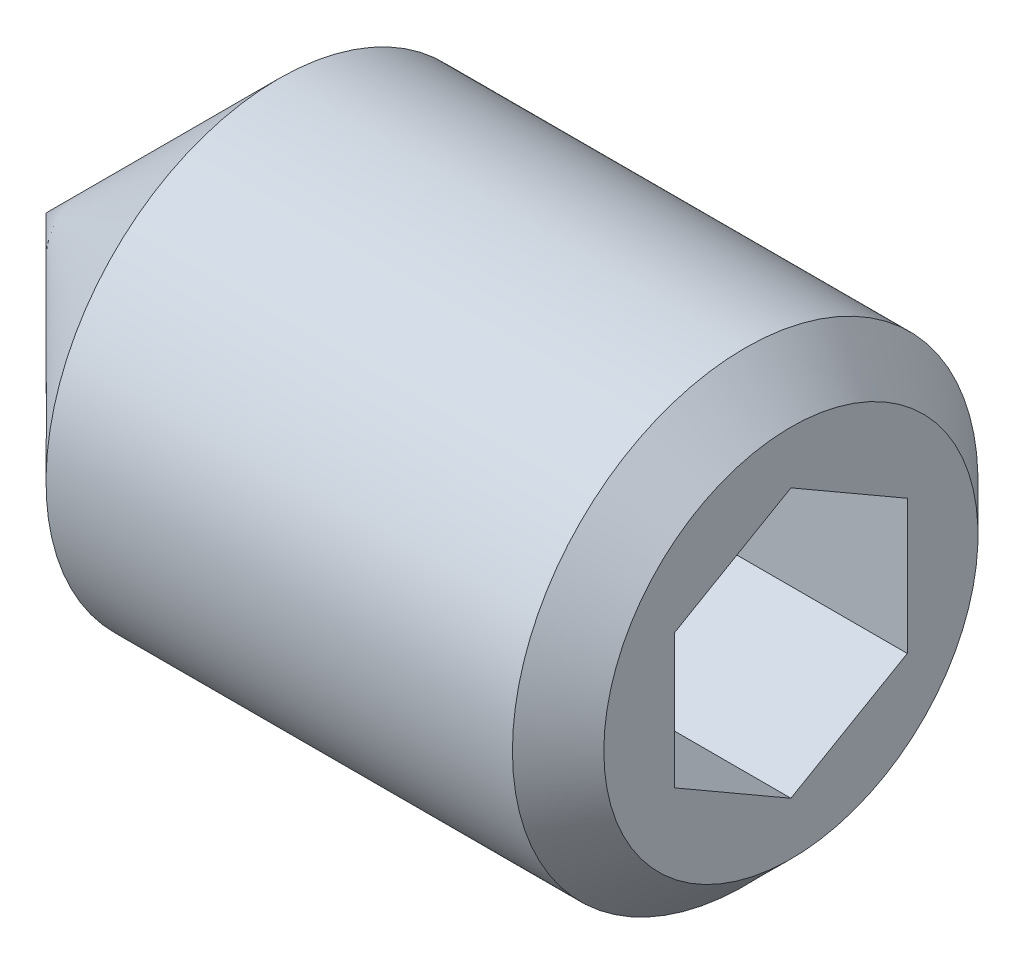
ISO-10303-21;
HEADER;
FILE_DESCRIPTION(('STEP AP214'),'2;1');
FILE_NAME('part.step','',(''),(''),'','','');
FILE_SCHEMA(('AUTOMOTIVE_DESIGN { 1 0 10303 214 1 1 1 1 }'));
ENDSEC;
DATA;
#1=APPLICATION_CONTEXT('core data for automotive mechanical design processes');
#2=APPLICATION_PROTOCOL_DEFINITION('international standard','automotive_design',2000,#1);
#3=PRODUCT_CONTEXT('',#1,'mechanical');
#4=PRODUCT('Part','Part','',(#3));
#5=PRODUCT_RELATED_PRODUCT_CATEGORY('part','',(#4));
#6=PRODUCT_DEFINITION_FORMATION('','',#4);
#7=PRODUCT_DEFINITION_CONTEXT('part definition',#1,'design');
#8=PRODUCT_DEFINITION('design','',#6,#7);
#9=PRODUCT_DEFINITION_SHAPE('','',#8);
#10=(LENGTH_UNIT() NAMED_UNIT(*) SI_UNIT(.MILLI.,.METRE.));
#11=(NAMED_UNIT(*) PLANE_ANGLE_UNIT() SI_UNIT($,.RADIAN.));
#12=(NAMED_UNIT(*) SI_UNIT($,.STERADIAN.) SOLID_ANGLE_UNIT());
#13=UNCERTAINTY_MEASURE_WITH_UNIT(LENGTH_MEASURE(1.E-05),#10,'distance_accuracy_value','');
#14=(GEOMETRIC_REPRESENTATION_CONTEXT(3) GLOBAL_UNCERTAINTY_ASSIGNED_CONTEXT((#13)) GLOBAL_UNIT_ASSIGNED_CONTEXT((#10,
#11,#12)) REPRESENTATION_CONTEXT('',''));
#15=CARTESIAN_POINT('',(0.,0.,0.));
#16=DIRECTION('',(0.,0.,1.));
#17=DIRECTION('',(1.,0.,0.));
#18=AXIS2_PLACEMENT_3D('',#15,#16,#17);
#19=CARTESIAN_POINT('',(7.99999999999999,-0.721687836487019,-1.25));
#20=DIRECTION('',(0.,0.,-1.));
#21=DIRECTION('',(-1.,0.,0.));
#22=AXIS2_PLACEMENT_3D('',#19,#20,#21);
#23=PLANE('',#22);
#24=DIRECTION('',(1.,0.,0.));
#25=VECTOR('',#24,1.);
#26=CARTESIAN_POINT('',(7.99999999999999,-0.721687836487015,-1.25000000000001));
#27=LINE('',#26,#25);
#28=CARTESIAN_POINT('',(5.00000000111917,-0.721687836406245,-1.2499999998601));
#29=VERTEX_POINT('',#28);
#30=CARTESIAN_POINT('',(7.99999999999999,-0.721687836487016,-1.25));
#31=VERTEX_POINT('',#30);
#32=EDGE_CURVE('E77',#29,#31,#27,.T.);
#33=ORIENTED_EDGE('',*,*,#32,.T.);
#34=DIRECTION('',(0.,1.,0.));
#35=VECTOR('',#34,1.);
#36=CARTESIAN_POINT('',(7.99999999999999,-0.721687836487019,-1.25));
#37=LINE('',#36,#35);
#38=CARTESIAN_POINT('',(7.99999999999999,0.721687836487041,-1.25));
#39=VERTEX_POINT('',#38);
#40=EDGE_CURVE('E83',#39,#31,#37,.F.);
#41=ORIENTED_EDGE('',*,*,#40,.F.);
#42=DIRECTION('',(1.,0.,0.));
#43=VECTOR('',#42,1.);
#44=CARTESIAN_POINT('',(7.99999999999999,0.721687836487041,-1.25));
#45=LINE('',#44,#43);
#46=CARTESIAN_POINT('',(5.00000000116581,0.721687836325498,-1.25));
#47=VERTEX_POINT('',#46);
#48=EDGE_CURVE('E80',#39,#47,#45,.F.);
#49=ORIENTED_EDGE('',*,*,#48,.T.);
#50=CARTESIAN_POINT('',(5.00000000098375,-0.721687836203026,-1.25000000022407));
#51=CARTESIAN_POINT('',(4.98168471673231,-0.658260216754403,-1.25000000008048));
#52=CARTESIAN_POINT('',(4.96502792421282,-0.594285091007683,-1.25000000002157));
#53=CARTESIAN_POINT('',(4.93595399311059,-0.465227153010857,-1.24999999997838));
#54=CARTESIAN_POINT('',(4.92354713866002,-0.400142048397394,-1.24999999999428));
#55=CARTESIAN_POINT('',(4.90423497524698,-0.270778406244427,-1.25000000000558));
#56=CARTESIAN_POINT('',(4.89720111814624,-0.206519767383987,-1.25000000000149));
#57=CARTESIAN_POINT('',(4.88880573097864,-0.0777002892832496,-1.24999999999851));
#58=CARTESIAN_POINT('',(4.88743724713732,-0.0131399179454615,-1.24999999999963));
#59=CARTESIAN_POINT('',(4.8902914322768,0.107484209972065,-1.25000000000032));
#60=CARTESIAN_POINT('',(4.89381330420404,0.163566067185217,-1.25000000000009));
#61=CARTESIAN_POINT('',(4.90497331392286,0.275364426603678,-1.24999999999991));
#62=CARTESIAN_POINT('',(4.91261526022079,0.331080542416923,-1.24999999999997));
#63=CARTESIAN_POINT('',(4.93171864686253,0.443109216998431,-1.25000000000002));
#64=CARTESIAN_POINT('',(4.94326102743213,0.499407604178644,-1.25000000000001));
#65=CARTESIAN_POINT('',(4.96945735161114,0.611164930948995,-1.24999999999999));
#66=CARTESIAN_POINT('',(4.98410514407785,0.666625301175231,-1.24999999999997));
#67=CARTESIAN_POINT('',(5.00000000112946,0.721687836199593,-1.25));
#68=B_SPLINE_CURVE_WITH_KNOTS('',3,(#50,#51,#52,#53,#54,#55,#56,#57,#58,#59,#60,#61,#62,#63,#64,
#65,#66,#67),.UNSPECIFIED.,.F.,.F.,(4,2,2,2,2,2,2,2,4),(0.,0.198135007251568,0.396746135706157,
0.590442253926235,0.783900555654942,0.952317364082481,1.12089012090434,1.29320101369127,
1.46517373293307),.UNSPECIFIED.);
#69=EDGE_CURVE('E20',#29,#47,#68,.T.);
#70=ORIENTED_EDGE('',*,*,#69,.F.);
#71=EDGE_LOOP('',(#33,#41,#49,#70));
#72=FACE_BOUND('',#71,.T.);
#73=ADVANCED_FACE('F16',(#72),#23,.F.);
#74=CARTESIAN_POINT('',(7.99999999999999,-1.44337567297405,0.));
#75=DIRECTION('',(0.,-0.866025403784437,-0.500000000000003));
#76=DIRECTION('',(0.,0.500000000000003,-0.866025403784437));
#77=AXIS2_PLACEMENT_3D('',#74,#75,#76);
#78=PLANE('',#77);
#79=DIRECTION('',(1.,0.,0.));
#80=VECTOR('',#79,1.);
#81=CARTESIAN_POINT('',(7.99999999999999,-1.44337567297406,0.));
#82=LINE('',#81,#80);
#83=CARTESIAN_POINT('',(5.00000000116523,-1.4433756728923,-1.41620604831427E-10));
#84=VERTEX_POINT('',#83);
#85=CARTESIAN_POINT('',(7.99999999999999,-1.44337567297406,0.));
#86=VERTEX_POINT('',#85);
#87=EDGE_CURVE('E144',#84,#86,#82,.T.);
#88=ORIENTED_EDGE('',*,*,#87,.T.);
#89=DIRECTION('',(0.,0.500000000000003,-0.866025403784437));
#90=VECTOR('',#89,1.);
#91=CARTESIAN_POINT('',(7.99999999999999,-1.44337567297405,0.));
#92=LINE('',#91,#90);
#93=EDGE_CURVE('E93',#31,#86,#92,.F.);
#94=ORIENTED_EDGE('',*,*,#93,.F.);
#95=ORIENTED_EDGE('',*,*,#32,.F.);
#96=CARTESIAN_POINT('',(5.00000000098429,-1.44337567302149,-3.60436117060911E-10));
#97=CARTESIAN_POINT('',(4.98168471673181,-1.41166186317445,-0.0549299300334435));
#98=CARTESIAN_POINT('',(4.96502792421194,-1.37967430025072,-0.110334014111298));
#99=CARTESIAN_POINT('',(4.93595399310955,-1.31514533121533,-0.22210146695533));
#100=CARTESIAN_POINT('',(4.92354713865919,-1.28260277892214,-0.278466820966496));
#101=CARTESIAN_POINT('',(4.90423497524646,-1.21792095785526,-0.390499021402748));
#102=CARTESIAN_POINT('',(4.89720111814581,-1.18579163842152,-0.446148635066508));
#103=CARTESIAN_POINT('',(4.88880573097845,-1.12138189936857,-0.557709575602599));
#104=CARTESIAN_POINT('',(4.88743724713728,-1.0891017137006,-0.613620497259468));
#105=CARTESIAN_POINT('',(4.89029143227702,-1.02878964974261,-0.718084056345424));
#106=CARTESIAN_POINT('',(4.89381330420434,-1.00074872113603,-0.766652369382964));
#107=CARTESIAN_POINT('',(4.90497331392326,-0.944849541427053,-0.863472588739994));
#108=CARTESIAN_POINT('',(4.9126152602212,-0.916991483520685,-0.911724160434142));
#109=CARTESIAN_POINT('',(4.9317186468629,-0.860977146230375,-1.00874383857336));
#110=CARTESIAN_POINT('',(4.94326102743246,-0.832827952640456,-1.05749967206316));
#111=CARTESIAN_POINT('',(4.96945735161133,-0.776949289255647,-1.15428435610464));
#112=CARTESIAN_POINT('',(4.98410514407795,-0.749219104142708,-1.20231444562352));
#113=CARTESIAN_POINT('',(5.00000000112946,-0.721687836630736,-1.24999999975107));
#114=B_SPLINE_CURVE_WITH_KNOTS('',3,(#96,#97,#98,#99,#100,#101,#102,#103,#104,#105,#106,#107,
#108,#109,#110,#111,#112,#113),.UNSPECIFIED.,.F.,.F.,(4,2,2,2,2,2,2,2,4),(0.,0.198135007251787,
0.396746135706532,0.5904422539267,0.78390055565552,0.952317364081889,1.12089012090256,
1.29320101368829,1.46517373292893),.UNSPECIFIED.);
#115=EDGE_CURVE('E85',#84,#29,#114,.T.);
#116=ORIENTED_EDGE('',*,*,#115,.F.);
#117=EDGE_LOOP('',(#88,#94,#95,#116));
#118=FACE_BOUND('',#117,.T.);
#119=ADVANCED_FACE('F94',(#118),#78,.F.);
#120=CARTESIAN_POINT('',(7.99999999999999,0.721687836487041,-1.25));
#121=DIRECTION('',(0.,0.86602540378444,-0.499999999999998));
#122=DIRECTION('',(0.,0.499999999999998,0.86602540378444));
#123=AXIS2_PLACEMENT_3D('',#120,#121,#122);
#124=PLANE('',#123);
#125=ORIENTED_EDGE('',*,*,#48,.F.);
#126=DIRECTION('',(0.,0.499999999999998,0.86602540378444));
#127=VECTOR('',#126,1.);
#128=CARTESIAN_POINT('',(7.99999999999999,0.721687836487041,-1.25));
#129=LINE('',#128,#127);
#130=CARTESIAN_POINT('',(7.99999999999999,1.44337567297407,0.));
#131=VERTEX_POINT('',#130);
#132=EDGE_CURVE('E92',#131,#39,#129,.F.);
#133=ORIENTED_EDGE('',*,*,#132,.F.);
#134=DIRECTION('',(1.,0.,0.));
#135=VECTOR('',#134,1.);
#136=CARTESIAN_POINT('',(7.99999999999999,1.44337567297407,0.));
#137=LINE('',#136,#135);
#138=CARTESIAN_POINT('',(4.99999999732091,1.44337566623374,-1.16745889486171E-08));
#139=VERTEX_POINT('',#138);
#140=EDGE_CURVE('E189',#131,#139,#137,.F.);
#141=ORIENTED_EDGE('',*,*,#140,.T.);
#142=CARTESIAN_POINT('',(5.00000000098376,0.721687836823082,-1.24999999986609));
#143=CARTESIAN_POINT('',(4.98168471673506,0.753401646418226,-1.19507007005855));
#144=CARTESIAN_POINT('',(4.96502792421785,0.7853892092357,-1.13966598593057));
#145=CARTESIAN_POINT('',(4.93595399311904,0.849918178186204,-1.02789853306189));
#146=CARTESIAN_POINT('',(4.92354713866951,0.882460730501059,-0.971533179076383));
#147=CARTESIAN_POINT('',(4.90423497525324,0.947142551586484,-0.859500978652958));
#148=CARTESIAN_POINT('',(4.89720111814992,0.979271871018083,-0.803851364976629));
#149=CARTESIAN_POINT('',(4.88880573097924,1.04368161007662,-0.692290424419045));
#150=CARTESIAN_POINT('',(4.88743724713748,1.0759617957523,-0.63637950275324));
#151=CARTESIAN_POINT('',(4.89029143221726,1.13627385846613,-0.531915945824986));
#152=CARTESIAN_POINT('',(4.89381330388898,1.16431478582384,-0.483347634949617));
#153=CARTESIAN_POINT('',(4.90497331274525,1.22021396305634,-0.386527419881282));
#154=CARTESIAN_POINT('',(4.9126152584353,1.24807201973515,-0.338275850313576));
#155=CARTESIAN_POINT('',(4.93171864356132,1.30408635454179,-0.241256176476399));
#156=CARTESIAN_POINT('',(4.94326102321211,1.33223554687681,-0.19250034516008));
#157=CARTESIAN_POINT('',(4.96945734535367,1.38811420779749,-0.0957156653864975));
#158=CARTESIAN_POINT('',(4.98410513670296,1.41584439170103,-0.0476855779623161));
#159=CARTESIAN_POINT('',(4.99999999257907,1.44337565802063,-2.5900118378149E-08));
#160=B_SPLINE_CURVE_WITH_KNOTS('',3,(#142,#143,#144,#145,#146,#147,#148,#149,#150,#151,#152,
#153,#154,#155,#156,#157,#158,#159),.UNSPECIFIED.,.F.,.F.,(4,2,2,2,2,2,2,2,4),(0.,
0.198135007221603,0.396746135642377,0.590442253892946,0.783900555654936,0.952317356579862,
1.12089010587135,1.29320099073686,1.46517370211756),.UNSPECIFIED.);
#161=EDGE_CURVE('E139',#47,#139,#160,.T.);
#162=ORIENTED_EDGE('',*,*,#161,.F.);
#163=EDGE_LOOP('',(#125,#133,#141,#162));
#164=FACE_BOUND('',#163,.T.);
#165=ADVANCED_FACE('F145',(#164),#124,.F.);
#166=CARTESIAN_POINT('',(7.99999999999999,-0.721687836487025,1.25));
#167=DIRECTION('',(0.,-0.86602540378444,0.499999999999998));
#168=DIRECTION('',(0.,-0.499999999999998,-0.86602540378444));
#169=AXIS2_PLACEMENT_3D('',#166,#167,#168);
#170=PLANE('',#169);
#171=DIRECTION('',(1.,0.,0.));
#172=VECTOR('',#171,1.);
#173=CARTESIAN_POINT('',(7.99999999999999,-0.721687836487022,1.25));
#174=LINE('',#173,#172);
#175=CARTESIAN_POINT('',(4.99999999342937,-0.721687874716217,1.24999996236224));
#176=VERTEX_POINT('',#175);
#177=CARTESIAN_POINT('',(7.99999999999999,-0.721687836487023,1.25));
#178=VERTEX_POINT('',#177);
#179=EDGE_CURVE('E197',#176,#178,#174,.T.);
#180=ORIENTED_EDGE('',*,*,#179,.T.);
#181=DIRECTION('',(0.,-0.499999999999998,-0.86602540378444));
#182=VECTOR('',#181,1.);
#183=CARTESIAN_POINT('',(7.99999999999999,-0.721687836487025,1.25));
#184=LINE('',#183,#182);
#185=EDGE_CURVE('E190',#86,#178,#184,.F.);
#186=ORIENTED_EDGE('',*,*,#185,.F.);
#187=ORIENTED_EDGE('',*,*,#87,.F.);
#188=CARTESIAN_POINT('',(5.0000000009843,-1.44337567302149,3.60410740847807E-10));
#189=CARTESIAN_POINT('',(4.98168471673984,-1.41166186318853,0.0549299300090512));
#190=CARTESIAN_POINT('',(4.96502792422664,-1.37967430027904,0.110334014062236));
#191=CARTESIAN_POINT('',(4.93595399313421,-1.31514533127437,0.222101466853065));
#192=CARTESIAN_POINT('',(4.9235471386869,-1.28260277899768,0.278466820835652));
#193=CARTESIAN_POINT('',(4.90423497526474,-1.21792095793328,0.3904990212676));
#194=CARTESIAN_POINT('',(4.89720111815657,-1.18579163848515,0.446148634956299));
#195=CARTESIAN_POINT('',(4.88880573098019,-1.12138189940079,0.557709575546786));
#196=CARTESIAN_POINT('',(4.88743724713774,-1.08910171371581,0.613620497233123));
#197=CARTESIAN_POINT('',(4.89029143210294,-1.0287896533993,0.718084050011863));
#198=CARTESIAN_POINT('',(4.89381330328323,-1.00074872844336,0.766652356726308));
#199=CARTESIAN_POINT('',(4.90497331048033,-0.944849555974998,0.863472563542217));
#200=CARTESIAN_POINT('',(4.91261525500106,-0.916991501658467,0.911724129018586));
#201=CARTESIAN_POINT('',(4.93171863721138,-0.860977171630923,1.00874379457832));
#202=CARTESIAN_POINT('',(4.94326101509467,-0.832827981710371,1.0574996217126));
#203=CARTESIAN_POINT('',(4.96945733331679,-0.776949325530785,1.15428429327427));
#204=CARTESIAN_POINT('',(4.98410512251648,-0.749219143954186,1.20231437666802));
#205=CARTESIAN_POINT('',(4.99999997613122,-0.721687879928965,1.24999992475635));
#206=B_SPLINE_CURVE_WITH_KNOTS('',3,(#188,#189,#190,#191,#192,#193,#194,#195,#196,#197,#198,
#199,#200,#201,#202,#203,#204,#205),.UNSPECIFIED.,.F.,.F.,(4,2,2,2,2,2,2,2,4),(0.,
0.198135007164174,0.396746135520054,0.590442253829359,0.783900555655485,0.952317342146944,
1.12089007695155,1.29320094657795,1.46517364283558),.UNSPECIFIED.);
#207=EDGE_CURVE('E88',#84,#176,#206,.T.);
#208=ORIENTED_EDGE('',*,*,#207,.T.);
#209=EDGE_LOOP('',(#180,#186,#187,#208));
#210=FACE_BOUND('',#209,.T.);
#211=ADVANCED_FACE('F148',(#210),#170,.F.);
#212=CARTESIAN_POINT('',(7.99999999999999,1.44337567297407,0.));
#213=DIRECTION('',(0.,0.866025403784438,0.500000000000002));
#214=DIRECTION('',(0.,-0.500000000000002,0.866025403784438));
#215=AXIS2_PLACEMENT_3D('',#212,#213,#214);
#216=PLANE('',#215);
#217=ORIENTED_EDGE('',*,*,#140,.F.);
#218=DIRECTION('',(0.,-0.500000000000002,0.866025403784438));
#219=VECTOR('',#218,1.);
#220=CARTESIAN_POINT('',(7.99999999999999,1.44337567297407,0.));
#221=LINE('',#220,#219);
#222=CARTESIAN_POINT('',(7.99999999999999,0.721687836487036,1.25));
#223=VERTEX_POINT('',#222);
#224=EDGE_CURVE('E180',#223,#131,#221,.F.);
#225=ORIENTED_EDGE('',*,*,#224,.F.);
#226=DIRECTION('',(1.,0.,0.));
#227=VECTOR('',#226,1.);
#228=CARTESIAN_POINT('',(7.99999999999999,0.721687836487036,1.25));
#229=LINE('',#228,#227);
#230=CARTESIAN_POINT('',(4.99999998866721,0.721687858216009,1.24999996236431));
#231=VERTEX_POINT('',#230);
#232=EDGE_CURVE('E111',#223,#231,#229,.F.);
#233=ORIENTED_EDGE('',*,*,#232,.T.);
#234=CARTESIAN_POINT('',(4.99999997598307,0.721687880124,1.24999992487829));
#235=CARTESIAN_POINT('',(4.98168469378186,0.753401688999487,1.1950699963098));
#236=CARTESIAN_POINT('',(4.9650279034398,0.785389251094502,1.13966591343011));
#237=CARTESIAN_POINT('',(4.93595397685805,0.849918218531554,1.02789846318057));
#238=CARTESIAN_POINT('',(4.92354712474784,0.882460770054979,0.971533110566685));
#239=CARTESIAN_POINT('',(4.90423496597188,0.947142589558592,0.859500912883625));
#240=CARTESIAN_POINT('',(4.89720111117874,0.979271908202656,0.803851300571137));
#241=CARTESIAN_POINT('',(4.8888057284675,1.04368164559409,0.692290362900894));
#242=CARTESIAN_POINT('',(4.88743724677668,1.07596183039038,0.636379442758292));
#243=CARTESIAN_POINT('',(4.89029143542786,1.13627388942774,0.531915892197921));
#244=CARTESIAN_POINT('',(4.89381330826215,1.16431481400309,0.483347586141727));
#245=CARTESIAN_POINT('',(4.90497331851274,1.22021398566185,0.38652738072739));
#246=CARTESIAN_POINT('',(4.9126152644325,1.24807203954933,0.3382758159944));
#247=CARTESIAN_POINT('',(4.9317186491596,1.30408636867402,0.24125615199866));
#248=CARTESIAN_POINT('',(4.94326102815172,1.33223555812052,0.192500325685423));
#249=CARTESIAN_POINT('',(4.96945734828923,1.3881142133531,0.0957156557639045));
#250=CARTESIAN_POINT('',(4.9841051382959,1.41584439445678,0.0476855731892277));
#251=CARTESIAN_POINT('',(4.99999999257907,1.44337565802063,2.59001224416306E-08));
#252=B_SPLINE_CURVE_WITH_KNOTS('',3,(#234,#235,#236,#237,#238,#239,#240,#241,#242,#243,#244,
#245,#246,#247,#248,#249,#250,#251),.UNSPECIFIED.,.F.,.F.,(4,2,2,2,2,2,2,2,4),(0.,
0.198135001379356,0.396746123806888,0.590442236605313,0.783900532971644,0.952317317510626,
1.12089005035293,1.2932009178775,1.465173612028),.UNSPECIFIED.);
#253=EDGE_CURVE('E135',#231,#139,#252,.T.);
#254=ORIENTED_EDGE('',*,*,#253,.T.);
#255=EDGE_LOOP('',(#217,#225,#233,#254));
#256=FACE_BOUND('',#255,.T.);
#257=ADVANCED_FACE('F123',(#256),#216,.F.);
#258=CARTESIAN_POINT('',(5.00500000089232,0.,0.));
#259=DIRECTION('',(1.,0.,0.));
#260=DIRECTION('',(0.,1.,0.));
#261=AXIS2_PLACEMENT_3D('',#258,#259,#260);
#262=CONICAL_SURFACE('',#261,1.45203592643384,1.04719755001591);
#263=CARTESIAN_POINT('',(4.1666666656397,5.6843418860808E-11,0.));
#264=VERTEX_POINT('',#263);
#265=VERTEX_LOOP('',#264);
#266=FACE_BOUND('',#265,.T.);
#267=ORIENTED_EDGE('',*,*,#207,.F.);
#268=ORIENTED_EDGE('',*,*,#115,.T.);
#269=ORIENTED_EDGE('',*,*,#69,.T.);
#270=ORIENTED_EDGE('',*,*,#161,.T.);
#271=ORIENTED_EDGE('',*,*,#253,.F.);
#272=CARTESIAN_POINT('',(5.00000003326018,0.721687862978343,1.24999996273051));
#273=CARTESIAN_POINT('',(4.98168473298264,0.658260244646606,1.24999998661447));
#274=CARTESIAN_POINT('',(4.96502793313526,0.594285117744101,1.24999999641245));
#275=CARTESIAN_POINT('',(4.93595399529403,0.465227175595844,1.25000000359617));
#276=CARTESIAN_POINT('',(4.92354714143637,0.400142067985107,1.25000000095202));
#277=CARTESIAN_POINT('',(4.9042349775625,0.270778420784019,1.24999999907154));
#278=CARTESIAN_POINT('',(4.8972011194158,0.206519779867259,1.2499999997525));
#279=CARTESIAN_POINT('',(4.88880573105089,0.0777002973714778,1.25000000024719));
#280=CARTESIAN_POINT('',(4.88743724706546,0.0131399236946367,1.25000000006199));
#281=CARTESIAN_POINT('',(4.89029143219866,-0.107484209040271,1.24999999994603));
#282=CARTESIAN_POINT('',(4.89381330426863,-0.163566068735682,1.24999999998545));
#283=CARTESIAN_POINT('',(4.90497331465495,-0.275364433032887,1.25000000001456));
#284=CARTESIAN_POINT('',(4.91261526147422,-0.331080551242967,1.2500000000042));
#285=CARTESIAN_POINT('',(4.93171864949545,-0.443109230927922,1.24999999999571));
#286=CARTESIAN_POINT('',(4.94326103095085,-0.499407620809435,1.24999999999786));
#287=CARTESIAN_POINT('',(4.9694573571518,-0.611164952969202,1.25000000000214));
#288=CARTESIAN_POINT('',(4.98410515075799,-0.666625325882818,1.25000000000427));
#289=CARTESIAN_POINT('',(5.0000000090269,-0.721687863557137,1.25));
#290=B_SPLINE_CURVE_WITH_KNOTS('',3,(#272,#273,#274,#275,#276,#277,#278,#279,#280,#281,#282,
#283,#284,#285,#286,#287,#288,#289),.UNSPECIFIED.,.F.,.F.,(4,2,2,2,2,2,2,2,4),(0.,
0.198135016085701,0.396746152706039,0.590442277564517,0.783900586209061,0.952317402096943,
1.12089016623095,1.29320106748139,1.46517379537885),.UNSPECIFIED.);
#291=EDGE_CURVE('E105',#231,#176,#290,.T.);
#292=ORIENTED_EDGE('',*,*,#291,.T.);
#293=EDGE_LOOP('',(#267,#268,#269,#270,#271,#292));
#294=FACE_BOUND('',#293,.T.);
#295=ADVANCED_FACE('F86',(#266,#294),#262,.F.);
#296=CARTESIAN_POINT('',(7.99999999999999,0.721687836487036,1.25));
#297=DIRECTION('',(0.,0.,1.));
#298=DIRECTION('',(1.,0.,0.));
#299=AXIS2_PLACEMENT_3D('',#296,#297,#298);
#300=PLANE('',#299);
#301=ORIENTED_EDGE('',*,*,#232,.F.);
#302=DIRECTION('',(0.,1.,0.));
#303=VECTOR('',#302,1.);
#304=CARTESIAN_POINT('',(7.99999999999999,0.,1.25));
#305=LINE('',#304,#303);
#306=EDGE_CURVE('E104',#223,#178,#305,.F.);
#307=ORIENTED_EDGE('',*,*,#306,.T.);
#308=ORIENTED_EDGE('',*,*,#179,.F.);
#309=ORIENTED_EDGE('',*,*,#291,.F.);
#310=EDGE_LOOP('',(#301,#307,#308,#309));
#311=FACE_BOUND('',#310,.T.);
#312=ADVANCED_FACE('F117',(#311),#300,.F.);
#313=CARTESIAN_POINT('',(7.99999999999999,0.,0.));
#314=DIRECTION('',(-1.,0.,0.));
#315=DIRECTION('',(0.,0.,1.));
#316=AXIS2_PLACEMENT_3D('',#313,#314,#315);
#317=PLANE('',#316);
#318=ORIENTED_EDGE('',*,*,#224,.T.);
#319=ORIENTED_EDGE('',*,*,#132,.T.);
#320=ORIENTED_EDGE('',*,*,#40,.T.);
#321=ORIENTED_EDGE('',*,*,#93,.T.);
#322=ORIENTED_EDGE('',*,*,#185,.T.);
#323=ORIENTED_EDGE('',*,*,#306,.F.);
#324=EDGE_LOOP('',(#318,#319,#320,#321,#322,#323));
#325=FACE_BOUND('',#324,.T.);
#326=CARTESIAN_POINT('',(8.00000000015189,0.,0.));
#327=DIRECTION('',(-1.,0.,0.));
#328=DIRECTION('',(0.,0.,1.));
#329=AXIS2_PLACEMENT_3D('',#326,#327,#328);
#330=CIRCLE('',#329,2.00924000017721);
#331=CARTESIAN_POINT('',(8.00000000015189,0.,2.00924000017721));
#332=VERTEX_POINT('',#331);
#333=EDGE_CURVE('E101',#332,#332,#330,.T.);
#334=ORIENTED_EDGE('',*,*,#333,.F.);
#335=EDGE_LOOP('',(#334));
#336=FACE_BOUND('',#335,.T.);
#337=ADVANCED_FACE('F171',(#325,#336),#317,.F.);
#338=CARTESIAN_POINT('',(2.49999499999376,0.,0.));
#339=DIRECTION('',(1.,0.,0.));
#340=DIRECTION('',(0.,1.,0.));
#341=AXIS2_PLACEMENT_3D('',#338,#339,#340);
#342=CONICAL_SURFACE('',#341,2.49999999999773,0.785399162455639);
#343=CARTESIAN_POINT('',(-4.60431692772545E-09,-1.13686837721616E-10,0.));
#344=VERTEX_POINT('',#343);
#345=VERTEX_LOOP('',#344);
#346=FACE_BOUND('',#345,.T.);
#347=CARTESIAN_POINT('',(2.499995,0.,0.));
#348=DIRECTION('',(1.,0.,0.));
#349=DIRECTION('',(0.,1.,0.));
#350=AXIS2_PLACEMENT_3D('',#347,#348,#349);
#351=CIRCLE('',#350,2.5);
#352=CARTESIAN_POINT('',(2.499995,2.5,0.));
#353=VERTEX_POINT('',#352);
#354=EDGE_CURVE('E30',#353,#353,#351,.T.);
#355=ORIENTED_EDGE('',*,*,#354,.F.);
#356=EDGE_LOOP('',(#355));
#357=FACE_BOUND('',#356,.T.);
#358=ADVANCED_FACE('F165',(#346,#357),#342,.T.);
#359=CARTESIAN_POINT('',(7.50923999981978,0.,0.));
#360=DIRECTION('',(-1.,0.,0.));
#361=DIRECTION('',(0.,0.,1.));
#362=AXIS2_PLACEMENT_3D('',#359,#360,#361);
#363=CONICAL_SURFACE('',#362,2.49999999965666,0.785398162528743);
#364=ORIENTED_EDGE('',*,*,#333,.T.);
#365=EDGE_LOOP('',(#364));
#366=FACE_BOUND('',#365,.T.);
#367=CARTESIAN_POINT('',(7.50923999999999,0.,0.));
#368=DIRECTION('',(1.,0.,0.));
#369=DIRECTION('',(0.,1.,0.));
#370=AXIS2_PLACEMENT_3D('',#367,#368,#369);
#371=CIRCLE('',#370,2.5);
#372=CARTESIAN_POINT('',(7.50923999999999,2.5,0.));
#373=VERTEX_POINT('',#372);
#374=EDGE_CURVE('E11',#373,#373,#371,.F.);
#375=ORIENTED_EDGE('',*,*,#374,.F.);
#376=EDGE_LOOP('',(#375));
#377=FACE_BOUND('',#376,.T.);
#378=ADVANCED_FACE('F159',(#366,#377),#363,.T.);
#379=CARTESIAN_POINT('',(3.99999999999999,0.,0.));
#380=DIRECTION('',(1.,0.,0.));
#381=DIRECTION('',(0.,1.,0.));
#382=AXIS2_PLACEMENT_3D('',#379,#380,#381);
#383=CYLINDRICAL_SURFACE('',#382,2.5);
#384=ORIENTED_EDGE('',*,*,#374,.T.);
#385=EDGE_LOOP('',(#384));
#386=FACE_BOUND('',#385,.T.);
#387=ORIENTED_EDGE('',*,*,#354,.T.);
#388=EDGE_LOOP('',(#387));
#389=FACE_BOUND('',#388,.T.);
#390=ADVANCED_FACE('F157',(#386,#389),#383,.T.);
#391=CLOSED_SHELL('',(#73,#119,#165,#211,#257,#295,#312,#337,#358,#378,#390));
#392=MANIFOLD_SOLID_BREP('B1',#391);
#393=ADVANCED_BREP_SHAPE_REPRESENTATION('',(#18,#392),#14);
#394=SHAPE_DEFINITION_REPRESENTATION(#9,#393);
ENDSEC;
END-ISO-10303-21;
